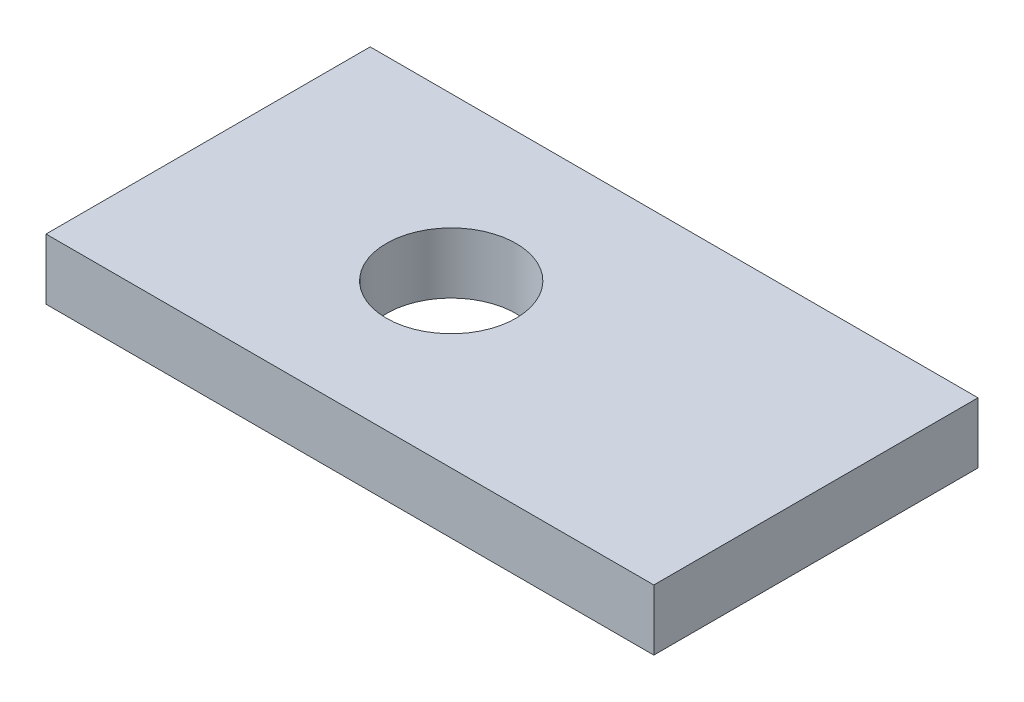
from build123d import *

# Parameters (mm, degrees)
BASESKETCH_W    = 150
BASESKETCH_H    = 80
BASEBOSS_DEPTH  = 15
HOLESKETCH_1_R  = 16
HOLECUT_1_DEPTH = 15


with BuildPart() as part:
    # BaseSketch → BaseBoss (new body)
    with BuildSketch(Plane(origin=(0, 0, 0), x_dir=(1, 0, 0), z_dir=(0, 1, 0))):
        with Locations((75, 40)):
            Rectangle(BASESKETCH_W, BASESKETCH_H)
    extrude(amount=-BASEBOSS_DEPTH)

    # HoleSketch_1 → HoleCut_1 (cut)
    with BuildSketch(Plane(origin=(0, 0, 0), x_dir=(1, 0, 0), z_dir=(0, 1, 0))):
        with Locations(Location((60, 40, 0), (0, 0, 270))):
            Circle(HOLESKETCH_1_R)
    extrude(amount=-HOLECUT_1_DEPTH, mode=Mode.SUBTRACT)


solid = part.part
